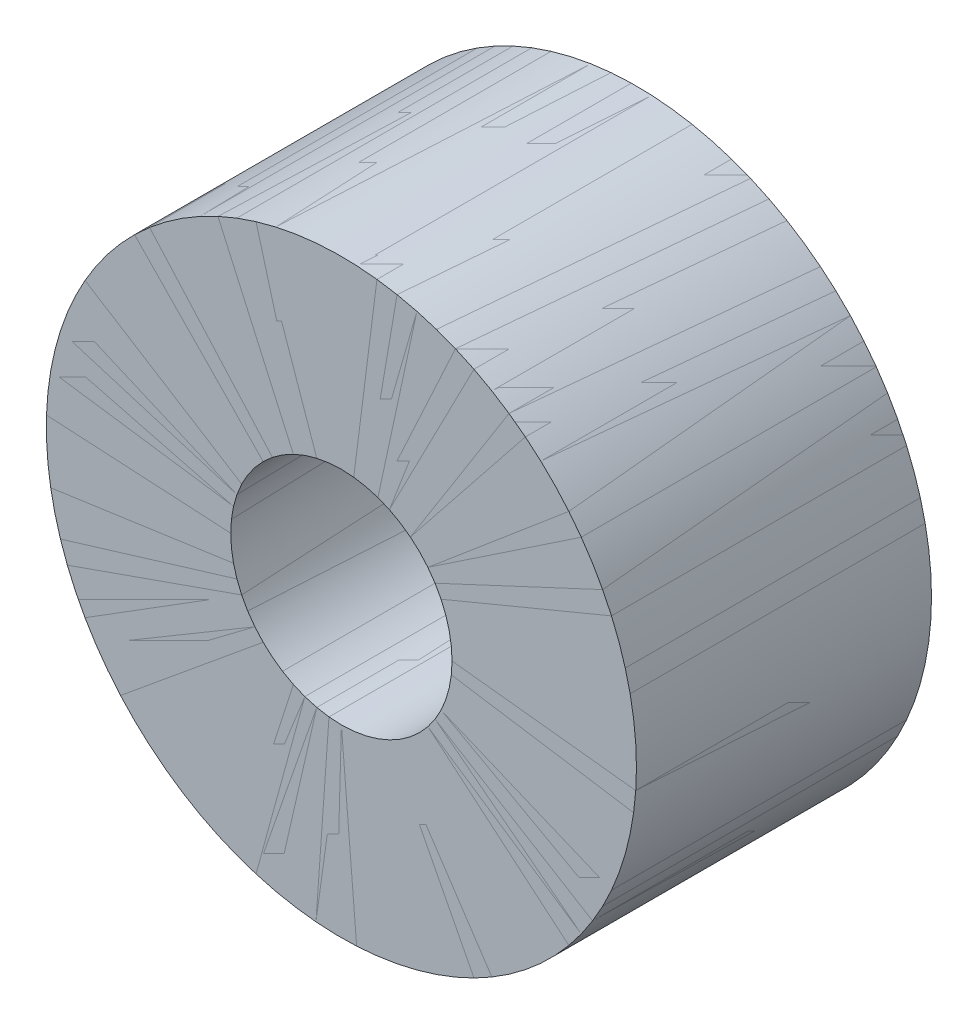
ISO-10303-21;
HEADER;
FILE_DESCRIPTION(('STEP AP214'),'2;1');
FILE_NAME('part.step','',(''),(''),'','','');
FILE_SCHEMA(('AUTOMOTIVE_DESIGN { 1 0 10303 214 1 1 1 1 }'));
ENDSEC;
DATA;
#1=APPLICATION_CONTEXT('core data for automotive mechanical design processes');
#2=APPLICATION_PROTOCOL_DEFINITION('international standard','automotive_design',2000,#1);
#3=PRODUCT_CONTEXT('',#1,'mechanical');
#4=PRODUCT('Part','Part','',(#3));
#5=PRODUCT_RELATED_PRODUCT_CATEGORY('part','',(#4));
#6=PRODUCT_DEFINITION_FORMATION('','',#4);
#7=PRODUCT_DEFINITION_CONTEXT('part definition',#1,'design');
#8=PRODUCT_DEFINITION('design','',#6,#7);
#9=PRODUCT_DEFINITION_SHAPE('','',#8);
#10=(LENGTH_UNIT() NAMED_UNIT(*) SI_UNIT(.MILLI.,.METRE.));
#11=(NAMED_UNIT(*) PLANE_ANGLE_UNIT() SI_UNIT($,.RADIAN.));
#12=(NAMED_UNIT(*) SI_UNIT($,.STERADIAN.) SOLID_ANGLE_UNIT());
#13=UNCERTAINTY_MEASURE_WITH_UNIT(LENGTH_MEASURE(1.E-05),#10,'distance_accuracy_value','');
#14=(GEOMETRIC_REPRESENTATION_CONTEXT(3) GLOBAL_UNCERTAINTY_ASSIGNED_CONTEXT((#13)) GLOBAL_UNIT_ASSIGNED_CONTEXT((#10,
#11,#12)) REPRESENTATION_CONTEXT('',''));
#15=CARTESIAN_POINT('',(0.,0.,0.));
#16=DIRECTION('',(0.,0.,1.));
#17=DIRECTION('',(1.,0.,0.));
#18=AXIS2_PLACEMENT_3D('',#15,#16,#17);
#19=CARTESIAN_POINT('',(-6.,-4.,-4.));
#20=DIRECTION('',(0.,0.,-1.));
#21=DIRECTION('',(-1.,0.,0.));
#22=AXIS2_PLACEMENT_3D('',#19,#20,#21);
#23=PLANE('',#22);
#24=CARTESIAN_POINT('',(-10.,0.,-4.));
#25=DIRECTION('',(0.,0.,-1.));
#26=DIRECTION('',(-1.,0.,0.));
#27=AXIS2_PLACEMENT_3D('',#24,#25,#26);
#28=CIRCLE('',#27,1.5);
#29=CARTESIAN_POINT('',(-11.5,0.,-4.));
#30=VERTEX_POINT('',#29);
#31=EDGE_CURVE('P0_E361',#30,#30,#28,.T.);
#32=ORIENTED_EDGE('',*,*,#31,.F.);
#33=EDGE_LOOP('',(#32));
#34=FACE_BOUND('',#33,.T.);
#35=CARTESIAN_POINT('',(-10.,0.,-4.));
#36=DIRECTION('',(0.,0.,1.));
#37=DIRECTION('',(1.,0.,0.));
#38=AXIS2_PLACEMENT_3D('',#35,#36,#37);
#39=CIRCLE('',#38,4.);
#40=CARTESIAN_POINT('',(-6.,0.,-4.));
#41=VERTEX_POINT('',#40);
#42=EDGE_CURVE('P0_E370',#41,#41,#39,.F.);
#43=ORIENTED_EDGE('',*,*,#42,.T.);
#44=EDGE_LOOP('',(#43));
#45=FACE_BOUND('',#44,.T.);
#46=ADVANCED_FACE('P0_F348',(#34,#45),#23,.T.);
#47=CARTESIAN_POINT('',(-10.,0.,-4.));
#48=DIRECTION('',(0.,0.,1.));
#49=DIRECTION('',(1.,0.,0.));
#50=AXIS2_PLACEMENT_3D('',#47,#48,#49);
#51=CYLINDRICAL_SURFACE('',#50,4.);
#52=ORIENTED_EDGE('',*,*,#42,.F.);
#53=EDGE_LOOP('',(#52));
#54=FACE_BOUND('',#53,.T.);
#55=CARTESIAN_POINT('',(-10.,0.,0.));
#56=DIRECTION('',(0.,0.,1.));
#57=DIRECTION('',(1.,0.,0.));
#58=AXIS2_PLACEMENT_3D('',#55,#56,#57);
#59=CIRCLE('',#58,4.);
#60=CARTESIAN_POINT('',(-6.,0.,0.));
#61=VERTEX_POINT('',#60);
#62=EDGE_CURVE('P0_E356',#61,#61,#59,.T.);
#63=ORIENTED_EDGE('',*,*,#62,.F.);
#64=EDGE_LOOP('',(#63));
#65=FACE_BOUND('',#64,.T.);
#66=ADVANCED_FACE('P0_F376',(#54,#65),#51,.T.);
#67=CARTESIAN_POINT('',(-10.,0.,0.));
#68=DIRECTION('',(0.,0.,-1.));
#69=DIRECTION('',(-1.,0.,0.));
#70=AXIS2_PLACEMENT_3D('',#67,#68,#69);
#71=CYLINDRICAL_SURFACE('',#70,1.5);
#72=ORIENTED_EDGE('',*,*,#31,.T.);
#73=EDGE_LOOP('',(#72));
#74=FACE_BOUND('',#73,.T.);
#75=CARTESIAN_POINT('',(-10.,0.,0.));
#76=DIRECTION('',(0.,0.,-1.));
#77=DIRECTION('',(-1.,0.,0.));
#78=AXIS2_PLACEMENT_3D('',#75,#76,#77);
#79=CIRCLE('',#78,1.5);
#80=CARTESIAN_POINT('',(-11.5,0.,0.));
#81=VERTEX_POINT('',#80);
#82=EDGE_CURVE('P0_E10',#81,#81,#79,.T.);
#83=ORIENTED_EDGE('',*,*,#82,.F.);
#84=EDGE_LOOP('',(#83));
#85=FACE_BOUND('',#84,.T.);
#86=ADVANCED_FACE('P0_F379',(#74,#85),#71,.F.);
#87=CARTESIAN_POINT('',(-14.,-4.,0.));
#88=DIRECTION('',(0.,0.,1.));
#89=DIRECTION('',(1.,0.,0.));
#90=AXIS2_PLACEMENT_3D('',#87,#88,#89);
#91=PLANE('',#90);
#92=ORIENTED_EDGE('',*,*,#82,.T.);
#93=EDGE_LOOP('',(#92));
#94=FACE_BOUND('',#93,.T.);
#95=ORIENTED_EDGE('',*,*,#62,.T.);
#96=EDGE_LOOP('',(#95));
#97=FACE_BOUND('',#96,.T.);
#98=ADVANCED_FACE('P0_F350',(#94,#97),#91,.T.);
#99=CLOSED_SHELL('',(#46,#66,#86,#98));
#100=MANIFOLD_SOLID_BREP('P0_B2',#99);
#101=CARTESIAN_POINT('',(-6.,-4.,-4.));
#102=DIRECTION('',(0.,0.,-1.));
#103=DIRECTION('',(-1.,0.,0.));
#104=AXIS2_PLACEMENT_3D('',#101,#102,#103);
#105=PLANE('',#104);
#106=CARTESIAN_POINT('',(-10.,0.,-4.));
#107=DIRECTION('',(0.,0.,-1.));
#108=DIRECTION('',(-1.,0.,0.));
#109=AXIS2_PLACEMENT_3D('',#106,#107,#108);
#110=CIRCLE('',#109,1.5);
#111=CARTESIAN_POINT('',(-11.5,0.,-4.));
#112=VERTEX_POINT('',#111);
#113=EDGE_CURVE('P1_E27',#112,#112,#110,.T.);
#114=ORIENTED_EDGE('',*,*,#113,.F.);
#115=EDGE_LOOP('',(#114));
#116=FACE_BOUND('',#115,.T.);
#117=CARTESIAN_POINT('',(-10.,0.,-4.));
#118=DIRECTION('',(0.,0.,1.));
#119=DIRECTION('',(1.,0.,0.));
#120=AXIS2_PLACEMENT_3D('',#117,#118,#119);
#121=CIRCLE('',#120,4.);
#122=CARTESIAN_POINT('',(-6.,0.,-4.));
#123=VERTEX_POINT('',#122);
#124=EDGE_CURVE('P1_E36',#123,#123,#121,.F.);
#125=ORIENTED_EDGE('',*,*,#124,.T.);
#126=EDGE_LOOP('',(#125));
#127=FACE_BOUND('',#126,.T.);
#128=ADVANCED_FACE('P1_F14',(#116,#127),#105,.T.);
#129=CARTESIAN_POINT('',(-10.,0.,-4.));
#130=DIRECTION('',(0.,0.,1.));
#131=DIRECTION('',(1.,0.,0.));
#132=AXIS2_PLACEMENT_3D('',#129,#130,#131);
#133=CYLINDRICAL_SURFACE('',#132,4.);
#134=ORIENTED_EDGE('',*,*,#124,.F.);
#135=EDGE_LOOP('',(#134));
#136=FACE_BOUND('',#135,.T.);
#137=CARTESIAN_POINT('',(-10.,0.,0.));
#138=DIRECTION('',(0.,0.,1.));
#139=DIRECTION('',(1.,0.,0.));
#140=AXIS2_PLACEMENT_3D('',#137,#138,#139);
#141=CIRCLE('',#140,4.);
#142=CARTESIAN_POINT('',(-6.,0.,0.));
#143=VERTEX_POINT('',#142);
#144=EDGE_CURVE('P1_E22',#143,#143,#141,.T.);
#145=ORIENTED_EDGE('',*,*,#144,.F.);
#146=EDGE_LOOP('',(#145));
#147=FACE_BOUND('',#146,.T.);
#148=ADVANCED_FACE('P1_F42',(#136,#147),#133,.T.);
#149=CARTESIAN_POINT('',(-10.,0.,0.));
#150=DIRECTION('',(0.,0.,-1.));
#151=DIRECTION('',(-1.,0.,0.));
#152=AXIS2_PLACEMENT_3D('',#149,#150,#151);
#153=CYLINDRICAL_SURFACE('',#152,1.5);
#154=ORIENTED_EDGE('',*,*,#113,.T.);
#155=EDGE_LOOP('',(#154));
#156=FACE_BOUND('',#155,.T.);
#157=CARTESIAN_POINT('',(-10.,0.,0.));
#158=DIRECTION('',(0.,0.,-1.));
#159=DIRECTION('',(-1.,0.,0.));
#160=AXIS2_PLACEMENT_3D('',#157,#158,#159);
#161=CIRCLE('',#160,1.5);
#162=CARTESIAN_POINT('',(-11.5,0.,0.));
#163=VERTEX_POINT('',#162);
#164=EDGE_CURVE('P1_E9',#163,#163,#161,.T.);
#165=ORIENTED_EDGE('',*,*,#164,.F.);
#166=EDGE_LOOP('',(#165));
#167=FACE_BOUND('',#166,.T.);
#168=ADVANCED_FACE('P1_F44',(#156,#167),#153,.F.);
#169=CARTESIAN_POINT('',(-14.,-4.,0.));
#170=DIRECTION('',(0.,0.,1.));
#171=DIRECTION('',(1.,0.,0.));
#172=AXIS2_PLACEMENT_3D('',#169,#170,#171);
#173=PLANE('',#172);
#174=ORIENTED_EDGE('',*,*,#164,.T.);
#175=EDGE_LOOP('',(#174));
#176=FACE_BOUND('',#175,.T.);
#177=ORIENTED_EDGE('',*,*,#144,.T.);
#178=EDGE_LOOP('',(#177));
#179=FACE_BOUND('',#178,.T.);
#180=ADVANCED_FACE('P1_F16',(#176,#179),#173,.T.);
#181=CLOSED_SHELL('',(#128,#148,#168,#180));
#182=MANIFOLD_SOLID_BREP('P1_B1',#181);
#183=ADVANCED_BREP_SHAPE_REPRESENTATION('',(#18,#100,#182),#14);
#184=SHAPE_DEFINITION_REPRESENTATION(#9,#183);
ENDSEC;
END-ISO-10303-21;
